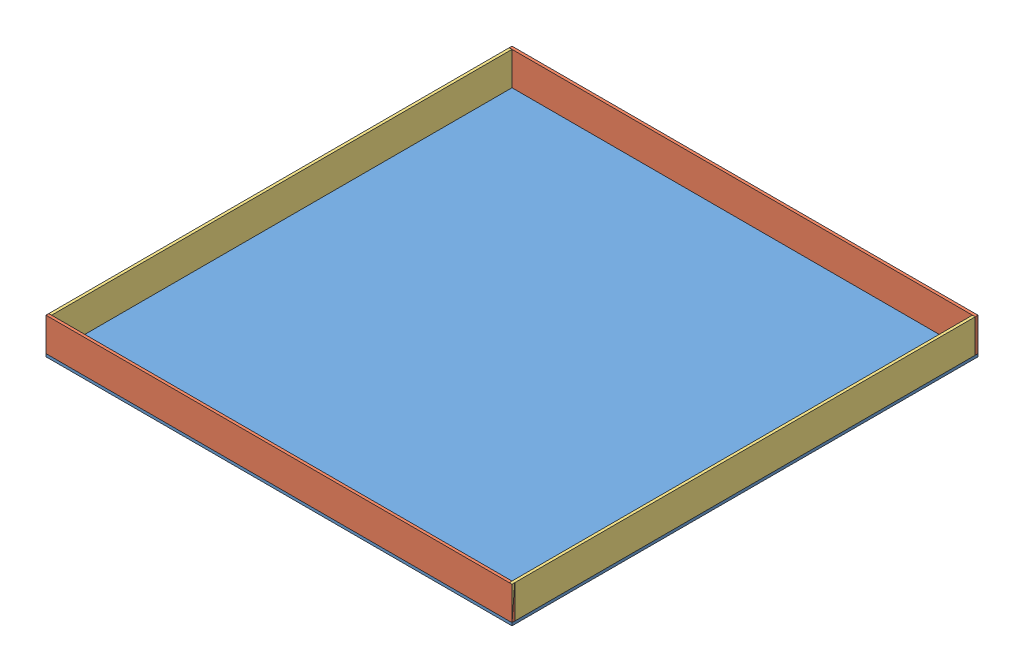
SolidWorks assembly platoform3-middle.SLDASM, configuration Default (file format 8000). Lengths in mm.
Overall size (1066.8 82.55 1066.8).
5 component instances, 3 part files, 12 mates.
Components (placement in the parent):
- Platform3-1: Platform3.SLDPRT [Default] at (434.9246 602.3995 766.003) size (1066.8 6.35 1066.8)
- Platform3-longside-1: Platform3-longside.SLDPRT [Default] at (434.9246 646.8495 1293.053) size (1066.8 76.2 6.35)
- Platform3-longside-2: Platform3-longside.SLDPRT [Default] at (434.9246 646.8495 232.603) size (1066.8 76.2 6.35)
- Platform3-shortside-1: Platform3-shortside.SLDPRT [Default] at (968.3246 646.8495 769.178) x (0 0 1) z (-1 0 0) size (1060.45 76.2 6.35)
- Platform3-shortside-2: Platform3-shortside.SLDPRT [Default] at (-92.1254 646.8495 769.178) x (0 0 1) z (-1 0 0) size (1060.45 76.2 6.35)
Mates (geometry in assembly coordinates):
- Coincident1: coincident aligned: plane of Platform3-1 through (-98.4754 608.7495 1299.403) normal (0 0 1); plane of Platform3-longside-1 through (434.9246 646.8495 1299.403) normal (0 0 1)
- Coincident2: coincident: line of Platform3-1 through (968.3246 608.7495 1299.403) axis (0 0 -1); plane of Platform3-longside-1 through (968.3246 608.7495 1299.403) normal (1 0 0)
- Coincident3: coincident anti-aligned: plane of Platform3-1 through (434.9246 608.7495 766.003) normal (0 1 0); plane of Platform3-longside-1 through (-98.4754 608.7495 1299.403) normal (0 -1 0)
- Coincident4: coincident aligned: plane of Platform3-1 through (-98.4754 608.7495 232.603) normal (0 0 -1); plane of Platform3-longside-2 through (434.9246 646.8495 232.603) normal (0 0 -1)
- Coincident5: coincident anti-aligned: plane of Platform3-1 through (434.9246 608.7495 766.003) normal (0 1 0); plane of Platform3-longside-2 through (-98.4754 608.7495 238.953) normal (0 -1 0)
- Coincident6: coincident aligned: plane of Platform3-1 through (968.3246 608.7495 232.603) normal (1 0 0); plane of Platform3-longside-2 through (968.3246 608.7495 238.953) normal (1 0 0)
- Coincident7: coincident aligned: plane of Platform3-longside-2 through (968.3246 608.7495 238.953) normal (1 0 0); plane of Platform3-shortside-1 through (968.3246 646.8495 769.178) normal (1 0 0)
- Coincident8: coincident anti-aligned: plane of Platform3-longside-2 through (434.9246 646.8495 238.953) normal (0 0 1); plane of Platform3-shortside-1 through (961.9746 608.7495 238.953) normal (0 0 -1)
- Coincident9: coincident anti-aligned: plane of Platform3-1 through (434.9246 608.7495 766.003) normal (0 1 0); plane of Platform3-shortside-1 through (961.9746 608.7495 238.953) normal (0 -1 0)
- Coincident10: coincident aligned: plane of Platform3-1 through (-98.4754 608.7495 232.603) normal (-1 0 0); plane of Platform3-shortside-2 through (-98.4754 646.8495 769.178) normal (-1 0 0)
- Coincident11: coincident anti-aligned: plane of Platform3-longside-2 through (434.9246 646.8495 238.953) normal (0 0 1); plane of Platform3-shortside-2 through (-98.4754 608.7495 238.953) normal (0 0 -1)
- Coincident12: coincident anti-aligned: plane of Platform3-1 through (434.9246 608.7495 766.003) normal (0 1 0); plane of Platform3-shortside-2 through (-98.4754 608.7495 238.953) normal (0 -1 0)
